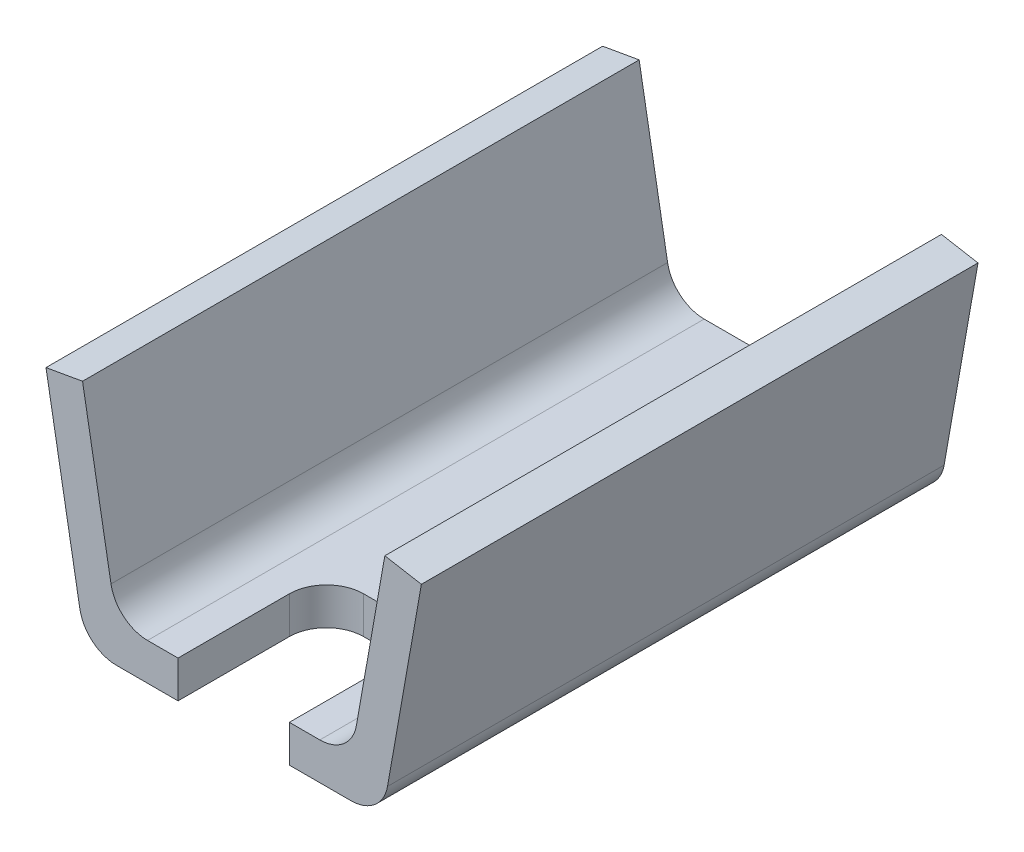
ISO-10303-21;
HEADER;
FILE_DESCRIPTION(('STEP AP214'),'2;1');
FILE_NAME('part.step','',(''),(''),'','','');
FILE_SCHEMA(('AUTOMOTIVE_DESIGN { 1 0 10303 214 1 1 1 1 }'));
ENDSEC;
DATA;
#1=APPLICATION_CONTEXT('core data for automotive mechanical design processes');
#2=APPLICATION_PROTOCOL_DEFINITION('international standard','automotive_design',2000,#1);
#3=PRODUCT_CONTEXT('',#1,'mechanical');
#4=PRODUCT('Part','Part','',(#3));
#5=PRODUCT_RELATED_PRODUCT_CATEGORY('part','',(#4));
#6=PRODUCT_DEFINITION_FORMATION('','',#4);
#7=PRODUCT_DEFINITION_CONTEXT('part definition',#1,'design');
#8=PRODUCT_DEFINITION('design','',#6,#7);
#9=PRODUCT_DEFINITION_SHAPE('','',#8);
#10=(LENGTH_UNIT() NAMED_UNIT(*) SI_UNIT(.MILLI.,.METRE.));
#11=(NAMED_UNIT(*) PLANE_ANGLE_UNIT() SI_UNIT($,.RADIAN.));
#12=(NAMED_UNIT(*) SI_UNIT($,.STERADIAN.) SOLID_ANGLE_UNIT());
#13=UNCERTAINTY_MEASURE_WITH_UNIT(LENGTH_MEASURE(1.E-05),#10,'distance_accuracy_value','');
#14=(GEOMETRIC_REPRESENTATION_CONTEXT(3) GLOBAL_UNCERTAINTY_ASSIGNED_CONTEXT((#13)) GLOBAL_UNIT_ASSIGNED_CONTEXT((#10,
#11,#12)) REPRESENTATION_CONTEXT('',''));
#15=CARTESIAN_POINT('',(0.,0.,0.));
#16=DIRECTION('',(0.,0.,1.));
#17=DIRECTION('',(1.,0.,0.));
#18=AXIS2_PLACEMENT_3D('',#15,#16,#17);
#19=CARTESIAN_POINT('',(11.6090036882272,10.,75.));
#20=DIRECTION('',(0.,0.,1.));
#21=DIRECTION('',(1.,0.,0.));
#22=AXIS2_PLACEMENT_3D('',#19,#20,#21);
#23=PLANE('',#22);
#24=DIRECTION('',(0.,-1.,0.));
#25=VECTOR('',#24,1.);
#26=CARTESIAN_POINT('',(-7.5,10.,75.));
#27=LINE('',#26,#25);
#28=CARTESIAN_POINT('',(-7.5,5.,75.));
#29=VERTEX_POINT('',#28);
#30=CARTESIAN_POINT('',(-7.5,0.,75.));
#31=VERTEX_POINT('',#30);
#32=EDGE_CURVE('E11',#29,#31,#27,.T.);
#33=ORIENTED_EDGE('',*,*,#32,.F.);
#34=DIRECTION('',(-1.,0.,0.));
#35=VECTOR('',#34,1.);
#36=CARTESIAN_POINT('',(11.6090036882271,5.,75.));
#37=LINE('',#36,#35);
#38=CARTESIAN_POINT('',(-11.6090036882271,5.,75.));
#39=VERTEX_POINT('',#38);
#40=EDGE_CURVE('E248',#29,#39,#37,.T.);
#41=ORIENTED_EDGE('',*,*,#40,.T.);
#42=CARTESIAN_POINT('',(-11.6090036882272,9.99999999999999,75.));
#43=DIRECTION('',(0.,0.,-1.));
#44=DIRECTION('',(-1.,0.,0.));
#45=AXIS2_PLACEMENT_3D('',#42,#43,#44);
#46=CIRCLE('',#45,5.);
#47=CARTESIAN_POINT('',(-16.5330424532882,9.13175911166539,75.));
#48=VERTEX_POINT('',#47);
#49=EDGE_CURVE('E247',#39,#48,#46,.T.);
#50=ORIENTED_EDGE('',*,*,#49,.T.);
#51=DIRECTION('',(-0.173648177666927,0.984807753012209,0.));
#52=VECTOR('',#51,1.);
#53=CARTESIAN_POINT('',(-16.5330424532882,9.13175911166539,75.));
#54=LINE('',#53,#52);
#55=CARTESIAN_POINT('',(-20.3657706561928,30.8682408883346,75.));
#56=VERTEX_POINT('',#55);
#57=EDGE_CURVE('E250',#48,#56,#54,.T.);
#58=ORIENTED_EDGE('',*,*,#57,.T.);
#59=DIRECTION('',(-0.984807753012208,-0.173648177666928,0.));
#60=VECTOR('',#59,1.);
#61=CARTESIAN_POINT('',(-25.2898094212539,30.,75.));
#62=LINE('',#61,#60);
#63=CARTESIAN_POINT('',(-25.2898094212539,30.,75.));
#64=VERTEX_POINT('',#63);
#65=EDGE_CURVE('E256',#56,#64,#62,.T.);
#66=ORIENTED_EDGE('',*,*,#65,.T.);
#67=DIRECTION('',(0.173648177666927,-0.984807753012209,0.));
#68=VECTOR('',#67,1.);
#69=CARTESIAN_POINT('',(-20.7285406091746,4.13175911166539,75.));
#70=LINE('',#69,#68);
#71=CARTESIAN_POINT('',(-20.7285406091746,4.13175911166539,75.));
#72=VERTEX_POINT('',#71);
#73=EDGE_CURVE('E258',#64,#72,#70,.T.);
#74=ORIENTED_EDGE('',*,*,#73,.T.);
#75=CARTESIAN_POINT('',(-15.8045018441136,5.,75.));
#76=DIRECTION('',(0.,0.,1.));
#77=DIRECTION('',(-1.,0.,0.));
#78=AXIS2_PLACEMENT_3D('',#75,#76,#77);
#79=CIRCLE('',#78,5.);
#80=CARTESIAN_POINT('',(-15.8045018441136,0.,75.));
#81=VERTEX_POINT('',#80);
#82=EDGE_CURVE('E153',#72,#81,#79,.T.);
#83=ORIENTED_EDGE('',*,*,#82,.T.);
#84=DIRECTION('',(1.,0.,0.));
#85=VECTOR('',#84,1.);
#86=CARTESIAN_POINT('',(-15.8045018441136,0.,75.));
#87=LINE('',#86,#85);
#88=EDGE_CURVE('E152',#81,#31,#87,.T.);
#89=ORIENTED_EDGE('',*,*,#88,.T.);
#90=EDGE_LOOP('',(#33,#41,#50,#58,#66,#74,#83,#89));
#91=FACE_BOUND('',#90,.T.);
#92=ADVANCED_FACE('F39',(#91),#23,.T.);
#93=CARTESIAN_POINT('',(25.2898094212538,30.,75.));
#94=DIRECTION('',(-0.173648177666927,-0.984807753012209,0.));
#95=DIRECTION('',(0.984807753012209,-0.173648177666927,0.));
#96=AXIS2_PLACEMENT_3D('',#93,#94,#95);
#97=PLANE('',#96);
#98=DIRECTION('',(-0.984807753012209,0.173648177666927,0.));
#99=VECTOR('',#98,1.);
#100=CARTESIAN_POINT('',(25.2898094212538,30.,0.));
#101=LINE('',#100,#99);
#102=CARTESIAN_POINT('',(25.2898094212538,30.,0.));
#103=VERTEX_POINT('',#102);
#104=CARTESIAN_POINT('',(20.3657706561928,30.8682408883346,0.));
#105=VERTEX_POINT('',#104);
#106=EDGE_CURVE('E174',#103,#105,#101,.T.);
#107=ORIENTED_EDGE('',*,*,#106,.T.);
#108=DIRECTION('',(0.,0.,-1.));
#109=VECTOR('',#108,1.);
#110=CARTESIAN_POINT('',(20.3657706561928,30.8682408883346,75.));
#111=LINE('',#110,#109);
#112=CARTESIAN_POINT('',(20.3657706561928,30.8682408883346,75.));
#113=VERTEX_POINT('',#112);
#114=EDGE_CURVE('E223',#113,#105,#111,.T.);
#115=ORIENTED_EDGE('',*,*,#114,.F.);
#116=DIRECTION('',(-0.984807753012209,0.173648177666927,0.));
#117=VECTOR('',#116,1.);
#118=CARTESIAN_POINT('',(25.2898094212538,30.,75.));
#119=LINE('',#118,#117);
#120=CARTESIAN_POINT('',(25.2898094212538,30.,75.));
#121=VERTEX_POINT('',#120);
#122=EDGE_CURVE('E198',#121,#113,#119,.T.);
#123=ORIENTED_EDGE('',*,*,#122,.F.);
#124=DIRECTION('',(0.,0.,-1.));
#125=VECTOR('',#124,1.);
#126=CARTESIAN_POINT('',(25.2898094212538,30.,75.));
#127=LINE('',#126,#125);
#128=EDGE_CURVE('E169',#121,#103,#127,.T.);
#129=ORIENTED_EDGE('',*,*,#128,.T.);
#130=EDGE_LOOP('',(#107,#115,#123,#129));
#131=FACE_BOUND('',#130,.T.);
#132=ADVANCED_FACE('F41',(#131),#97,.F.);
#133=CARTESIAN_POINT('',(20.3657706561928,30.8682408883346,75.));
#134=DIRECTION('',(0.984807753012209,-0.173648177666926,0.));
#135=DIRECTION('',(0.173648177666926,0.984807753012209,0.));
#136=AXIS2_PLACEMENT_3D('',#133,#134,#135);
#137=PLANE('',#136);
#138=DIRECTION('',(-0.173648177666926,-0.984807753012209,0.));
#139=VECTOR('',#138,1.);
#140=CARTESIAN_POINT('',(20.3657706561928,30.8682408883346,0.));
#141=LINE('',#140,#139);
#142=CARTESIAN_POINT('',(16.5330424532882,9.13175911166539,0.));
#143=VERTEX_POINT('',#142);
#144=EDGE_CURVE('E177',#105,#143,#141,.T.);
#145=ORIENTED_EDGE('',*,*,#144,.T.);
#146=DIRECTION('',(0.,0.,-1.));
#147=VECTOR('',#146,1.);
#148=CARTESIAN_POINT('',(16.5330424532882,9.13175911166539,75.));
#149=LINE('',#148,#147);
#150=CARTESIAN_POINT('',(16.5330424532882,9.13175911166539,75.));
#151=VERTEX_POINT('',#150);
#152=EDGE_CURVE('E220',#151,#143,#149,.T.);
#153=ORIENTED_EDGE('',*,*,#152,.F.);
#154=DIRECTION('',(-0.173648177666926,-0.984807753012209,0.));
#155=VECTOR('',#154,1.);
#156=CARTESIAN_POINT('',(20.3657706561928,30.8682408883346,75.));
#157=LINE('',#156,#155);
#158=EDGE_CURVE('E117',#113,#151,#157,.T.);
#159=ORIENTED_EDGE('',*,*,#158,.F.);
#160=ORIENTED_EDGE('',*,*,#114,.T.);
#161=EDGE_LOOP('',(#145,#153,#159,#160));
#162=FACE_BOUND('',#161,.T.);
#163=ADVANCED_FACE('F311',(#162),#137,.F.);
#164=CARTESIAN_POINT('',(11.6090036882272,10.,75.));
#165=DIRECTION('',(0.,0.,-1.));
#166=DIRECTION('',(-1.,0.,0.));
#167=AXIS2_PLACEMENT_3D('',#164,#165,#166);
#168=CYLINDRICAL_SURFACE('',#167,5.);
#169=CARTESIAN_POINT('',(11.6090036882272,10.,0.));
#170=DIRECTION('',(0.,0.,-1.));
#171=DIRECTION('',(1.,0.,0.));
#172=AXIS2_PLACEMENT_3D('',#169,#170,#171);
#173=CIRCLE('',#172,5.);
#174=CARTESIAN_POINT('',(11.6090036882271,5.,0.));
#175=VERTEX_POINT('',#174);
#176=EDGE_CURVE('E180',#143,#175,#173,.T.);
#177=ORIENTED_EDGE('',*,*,#176,.T.);
#178=DIRECTION('',(0.,0.,-1.));
#179=VECTOR('',#178,1.);
#180=CARTESIAN_POINT('',(11.6090036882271,5.,75.));
#181=LINE('',#180,#179);
#182=CARTESIAN_POINT('',(11.6090036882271,5.,75.));
#183=VERTEX_POINT('',#182);
#184=EDGE_CURVE('E217',#183,#175,#181,.T.);
#185=ORIENTED_EDGE('',*,*,#184,.F.);
#186=CARTESIAN_POINT('',(11.6090036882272,10.,75.));
#187=DIRECTION('',(0.,0.,-1.));
#188=DIRECTION('',(1.,0.,0.));
#189=AXIS2_PLACEMENT_3D('',#186,#187,#188);
#190=CIRCLE('',#189,5.);
#191=EDGE_CURVE('E245',#151,#183,#190,.T.);
#192=ORIENTED_EDGE('',*,*,#191,.F.);
#193=ORIENTED_EDGE('',*,*,#152,.T.);
#194=EDGE_LOOP('',(#177,#185,#192,#193));
#195=FACE_BOUND('',#194,.T.);
#196=ADVANCED_FACE('F314',(#195),#168,.F.);
#197=CARTESIAN_POINT('',(11.6090036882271,5.,75.));
#198=DIRECTION('',(0.,-1.,0.));
#199=DIRECTION('',(1.,0.,0.));
#200=AXIS2_PLACEMENT_3D('',#197,#198,#199);
#201=PLANE('',#200);
#202=ORIENTED_EDGE('',*,*,#40,.F.);
#203=DIRECTION('',(0.,0.,-1.));
#204=VECTOR('',#203,1.);
#205=CARTESIAN_POINT('',(-7.5,5.,75.));
#206=LINE('',#205,#204);
#207=CARTESIAN_POINT('',(-7.5,5.,60.));
#208=VERTEX_POINT('',#207);
#209=EDGE_CURVE('E241',#29,#208,#206,.T.);
#210=ORIENTED_EDGE('',*,*,#209,.T.);
#211=CARTESIAN_POINT('',(-2.5,5.,60.));
#212=DIRECTION('',(0.,-1.,0.));
#213=DIRECTION('',(1.,0.,0.));
#214=AXIS2_PLACEMENT_3D('',#211,#212,#213);
#215=CIRCLE('',#214,5.);
#216=CARTESIAN_POINT('',(-2.5,5.,55.));
#217=VERTEX_POINT('',#216);
#218=EDGE_CURVE('E303',#208,#217,#215,.T.);
#219=ORIENTED_EDGE('',*,*,#218,.T.);
#220=DIRECTION('',(1.,0.,0.));
#221=VECTOR('',#220,1.);
#222=CARTESIAN_POINT('',(11.6090036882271,5.,55.));
#223=LINE('',#222,#221);
#224=CARTESIAN_POINT('',(2.5,5.,55.));
#225=VERTEX_POINT('',#224);
#226=EDGE_CURVE('E306',#217,#225,#223,.T.);
#227=ORIENTED_EDGE('',*,*,#226,.T.);
#228=CARTESIAN_POINT('',(2.5,5.,60.));
#229=DIRECTION('',(0.,-1.,0.));
#230=DIRECTION('',(1.,0.,0.));
#231=AXIS2_PLACEMENT_3D('',#228,#229,#230);
#232=CIRCLE('',#231,5.);
#233=CARTESIAN_POINT('',(7.5,5.,60.));
#234=VERTEX_POINT('',#233);
#235=EDGE_CURVE('E178',#225,#234,#232,.T.);
#236=ORIENTED_EDGE('',*,*,#235,.T.);
#237=DIRECTION('',(0.,0.,1.));
#238=VECTOR('',#237,1.);
#239=CARTESIAN_POINT('',(7.49999999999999,5.,75.));
#240=LINE('',#239,#238);
#241=CARTESIAN_POINT('',(7.49999999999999,5.,75.));
#242=VERTEX_POINT('',#241);
#243=EDGE_CURVE('E229',#234,#242,#240,.T.);
#244=ORIENTED_EDGE('',*,*,#243,.T.);
#245=EDGE_CURVE('E238',#183,#242,#37,.T.);
#246=ORIENTED_EDGE('',*,*,#245,.F.);
#247=ORIENTED_EDGE('',*,*,#184,.T.);
#248=DIRECTION('',(-1.,0.,0.));
#249=VECTOR('',#248,1.);
#250=CARTESIAN_POINT('',(11.6090036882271,5.,0.));
#251=LINE('',#250,#249);
#252=CARTESIAN_POINT('',(-11.6090036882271,5.,0.));
#253=VERTEX_POINT('',#252);
#254=EDGE_CURVE('E182',#175,#253,#251,.T.);
#255=ORIENTED_EDGE('',*,*,#254,.T.);
#256=DIRECTION('',(0.,0.,-1.));
#257=VECTOR('',#256,1.);
#258=CARTESIAN_POINT('',(-11.6090036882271,5.,75.));
#259=LINE('',#258,#257);
#260=EDGE_CURVE('E214',#39,#253,#259,.T.);
#261=ORIENTED_EDGE('',*,*,#260,.F.);
#262=EDGE_LOOP('',(#202,#210,#219,#227,#236,#244,#246,#247,#255,#261));
#263=FACE_BOUND('',#262,.T.);
#264=ADVANCED_FACE('F237',(#263),#201,.F.);
#265=CARTESIAN_POINT('',(-11.6090036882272,9.99999999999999,75.));
#266=DIRECTION('',(0.,0.,-1.));
#267=DIRECTION('',(-1.,0.,0.));
#268=AXIS2_PLACEMENT_3D('',#265,#266,#267);
#269=CYLINDRICAL_SURFACE('',#268,5.);
#270=CARTESIAN_POINT('',(-11.6090036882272,9.99999999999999,0.));
#271=DIRECTION('',(0.,0.,-1.));
#272=DIRECTION('',(-1.,0.,0.));
#273=AXIS2_PLACEMENT_3D('',#270,#271,#272);
#274=CIRCLE('',#273,5.);
#275=CARTESIAN_POINT('',(-16.5330424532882,9.13175911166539,0.));
#276=VERTEX_POINT('',#275);
#277=EDGE_CURVE('E184',#253,#276,#274,.T.);
#278=ORIENTED_EDGE('',*,*,#277,.T.);
#279=DIRECTION('',(0.,0.,-1.));
#280=VECTOR('',#279,1.);
#281=CARTESIAN_POINT('',(-16.5330424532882,9.13175911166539,75.));
#282=LINE('',#281,#280);
#283=EDGE_CURVE('E211',#48,#276,#282,.T.);
#284=ORIENTED_EDGE('',*,*,#283,.F.);
#285=ORIENTED_EDGE('',*,*,#49,.F.);
#286=ORIENTED_EDGE('',*,*,#260,.T.);
#287=EDGE_LOOP('',(#278,#284,#285,#286));
#288=FACE_BOUND('',#287,.T.);
#289=ADVANCED_FACE('F325',(#288),#269,.F.);
#290=CARTESIAN_POINT('',(-16.5330424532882,9.13175911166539,75.));
#291=DIRECTION('',(-0.984807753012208,-0.173648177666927,0.));
#292=DIRECTION('',(0.173648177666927,-0.984807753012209,0.));
#293=AXIS2_PLACEMENT_3D('',#290,#291,#292);
#294=PLANE('',#293);
#295=DIRECTION('',(-0.173648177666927,0.984807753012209,0.));
#296=VECTOR('',#295,1.);
#297=CARTESIAN_POINT('',(-16.5330424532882,9.13175911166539,0.));
#298=LINE('',#297,#296);
#299=CARTESIAN_POINT('',(-20.3657706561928,30.8682408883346,0.));
#300=VERTEX_POINT('',#299);
#301=EDGE_CURVE('E186',#276,#300,#298,.T.);
#302=ORIENTED_EDGE('',*,*,#301,.T.);
#303=DIRECTION('',(0.,0.,-1.));
#304=VECTOR('',#303,1.);
#305=CARTESIAN_POINT('',(-20.3657706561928,30.8682408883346,75.));
#306=LINE('',#305,#304);
#307=EDGE_CURVE('E208',#56,#300,#306,.T.);
#308=ORIENTED_EDGE('',*,*,#307,.F.);
#309=ORIENTED_EDGE('',*,*,#57,.F.);
#310=ORIENTED_EDGE('',*,*,#283,.T.);
#311=EDGE_LOOP('',(#302,#308,#309,#310));
#312=FACE_BOUND('',#311,.T.);
#313=ADVANCED_FACE('F329',(#312),#294,.F.);
#314=CARTESIAN_POINT('',(-25.2898094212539,30.,75.));
#315=DIRECTION('',(0.173648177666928,-0.984807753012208,0.));
#316=DIRECTION('',(0.984807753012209,0.173648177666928,0.));
#317=AXIS2_PLACEMENT_3D('',#314,#315,#316);
#318=PLANE('',#317);
#319=DIRECTION('',(-0.984807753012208,-0.173648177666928,0.));
#320=VECTOR('',#319,1.);
#321=CARTESIAN_POINT('',(-25.2898094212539,30.,0.));
#322=LINE('',#321,#320);
#323=CARTESIAN_POINT('',(-25.2898094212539,30.,0.));
#324=VERTEX_POINT('',#323);
#325=EDGE_CURVE('E188',#300,#324,#322,.T.);
#326=ORIENTED_EDGE('',*,*,#325,.T.);
#327=DIRECTION('',(0.,0.,-1.));
#328=VECTOR('',#327,1.);
#329=CARTESIAN_POINT('',(-25.2898094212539,30.,75.));
#330=LINE('',#329,#328);
#331=EDGE_CURVE('E205',#64,#324,#330,.T.);
#332=ORIENTED_EDGE('',*,*,#331,.F.);
#333=ORIENTED_EDGE('',*,*,#65,.F.);
#334=ORIENTED_EDGE('',*,*,#307,.T.);
#335=EDGE_LOOP('',(#326,#332,#333,#334));
#336=FACE_BOUND('',#335,.T.);
#337=ADVANCED_FACE('F388',(#336),#318,.F.);
#338=CARTESIAN_POINT('',(-20.7285406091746,4.13175911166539,75.));
#339=DIRECTION('',(0.984807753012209,0.173648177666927,0.));
#340=DIRECTION('',(-0.173648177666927,0.984807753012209,0.));
#341=AXIS2_PLACEMENT_3D('',#338,#339,#340);
#342=PLANE('',#341);
#343=DIRECTION('',(0.173648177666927,-0.984807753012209,0.));
#344=VECTOR('',#343,1.);
#345=CARTESIAN_POINT('',(-20.7285406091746,4.13175911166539,0.));
#346=LINE('',#345,#344);
#347=CARTESIAN_POINT('',(-20.7285406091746,4.13175911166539,0.));
#348=VERTEX_POINT('',#347);
#349=EDGE_CURVE('E190',#324,#348,#346,.T.);
#350=ORIENTED_EDGE('',*,*,#349,.T.);
#351=DIRECTION('',(0.,0.,-1.));
#352=VECTOR('',#351,1.);
#353=CARTESIAN_POINT('',(-20.7285406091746,4.13175911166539,75.));
#354=LINE('',#353,#352);
#355=EDGE_CURVE('E202',#72,#348,#354,.T.);
#356=ORIENTED_EDGE('',*,*,#355,.F.);
#357=ORIENTED_EDGE('',*,*,#73,.F.);
#358=ORIENTED_EDGE('',*,*,#331,.T.);
#359=EDGE_LOOP('',(#350,#356,#357,#358));
#360=FACE_BOUND('',#359,.T.);
#361=ADVANCED_FACE('F385',(#360),#342,.F.);
#362=CARTESIAN_POINT('',(-15.8045018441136,5.,75.));
#363=DIRECTION('',(0.,0.,-1.));
#364=DIRECTION('',(-1.,0.,0.));
#365=AXIS2_PLACEMENT_3D('',#362,#363,#364);
#366=CYLINDRICAL_SURFACE('',#365,5.);
#367=CARTESIAN_POINT('',(-15.8045018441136,5.,0.));
#368=DIRECTION('',(0.,0.,1.));
#369=DIRECTION('',(-1.,0.,0.));
#370=AXIS2_PLACEMENT_3D('',#367,#368,#369);
#371=CIRCLE('',#370,5.);
#372=CARTESIAN_POINT('',(-15.8045018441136,0.,0.));
#373=VERTEX_POINT('',#372);
#374=EDGE_CURVE('E192',#348,#373,#371,.T.);
#375=ORIENTED_EDGE('',*,*,#374,.T.);
#376=DIRECTION('',(0.,0.,-1.));
#377=VECTOR('',#376,1.);
#378=CARTESIAN_POINT('',(-15.8045018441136,0.,75.));
#379=LINE('',#378,#377);
#380=EDGE_CURVE('E164',#81,#373,#379,.T.);
#381=ORIENTED_EDGE('',*,*,#380,.F.);
#382=ORIENTED_EDGE('',*,*,#82,.F.);
#383=ORIENTED_EDGE('',*,*,#355,.T.);
#384=EDGE_LOOP('',(#375,#381,#382,#383));
#385=FACE_BOUND('',#384,.T.);
#386=ADVANCED_FACE('F268',(#385),#366,.T.);
#387=CARTESIAN_POINT('',(-15.8045018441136,0.,75.));
#388=DIRECTION('',(0.,1.,0.));
#389=DIRECTION('',(0.,0.,1.));
#390=AXIS2_PLACEMENT_3D('',#387,#388,#389);
#391=PLANE('',#390);
#392=CARTESIAN_POINT('',(-2.5,0.,60.));
#393=DIRECTION('',(0.,-1.,0.));
#394=DIRECTION('',(0.,0.,1.));
#395=AXIS2_PLACEMENT_3D('',#392,#393,#394);
#396=CIRCLE('',#395,5.);
#397=CARTESIAN_POINT('',(-7.5,0.,60.));
#398=VERTEX_POINT('',#397);
#399=CARTESIAN_POINT('',(-2.5,0.,55.));
#400=VERTEX_POINT('',#399);
#401=EDGE_CURVE('E276',#398,#400,#396,.T.);
#402=ORIENTED_EDGE('',*,*,#401,.F.);
#403=DIRECTION('',(0.,0.,-1.));
#404=VECTOR('',#403,1.);
#405=CARTESIAN_POINT('',(-7.5,0.,60.));
#406=LINE('',#405,#404);
#407=EDGE_CURVE('E272',#31,#398,#406,.T.);
#408=ORIENTED_EDGE('',*,*,#407,.F.);
#409=ORIENTED_EDGE('',*,*,#88,.F.);
#410=ORIENTED_EDGE('',*,*,#380,.T.);
#411=DIRECTION('',(1.,0.,0.));
#412=VECTOR('',#411,1.);
#413=CARTESIAN_POINT('',(-15.8045018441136,0.,0.));
#414=LINE('',#413,#412);
#415=CARTESIAN_POINT('',(15.8045018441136,0.,0.));
#416=VERTEX_POINT('',#415);
#417=EDGE_CURVE('E161',#373,#416,#414,.T.);
#418=ORIENTED_EDGE('',*,*,#417,.T.);
#419=DIRECTION('',(0.,0.,-1.));
#420=VECTOR('',#419,1.);
#421=CARTESIAN_POINT('',(15.8045018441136,0.,75.));
#422=LINE('',#421,#420);
#423=CARTESIAN_POINT('',(15.8045018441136,0.,75.));
#424=VERTEX_POINT('',#423);
#425=EDGE_CURVE('E156',#424,#416,#422,.T.);
#426=ORIENTED_EDGE('',*,*,#425,.F.);
#427=CARTESIAN_POINT('',(7.5,0.,75.));
#428=VERTEX_POINT('',#427);
#429=EDGE_CURVE('E144',#428,#424,#87,.T.);
#430=ORIENTED_EDGE('',*,*,#429,.F.);
#431=DIRECTION('',(0.,0.,1.));
#432=VECTOR('',#431,1.);
#433=CARTESIAN_POINT('',(7.49999999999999,0.,75.));
#434=LINE('',#433,#432);
#435=CARTESIAN_POINT('',(7.5,0.,60.));
#436=VERTEX_POINT('',#435);
#437=EDGE_CURVE('E54',#436,#428,#434,.T.);
#438=ORIENTED_EDGE('',*,*,#437,.F.);
#439=CARTESIAN_POINT('',(2.5,0.,60.));
#440=DIRECTION('',(0.,-1.,0.));
#441=DIRECTION('',(0.,0.,1.));
#442=AXIS2_PLACEMENT_3D('',#439,#440,#441);
#443=CIRCLE('',#442,5.);
#444=CARTESIAN_POINT('',(2.5,0.,55.));
#445=VERTEX_POINT('',#444);
#446=EDGE_CURVE('E287',#445,#436,#443,.T.);
#447=ORIENTED_EDGE('',*,*,#446,.F.);
#448=DIRECTION('',(1.,0.,0.));
#449=VECTOR('',#448,1.);
#450=CARTESIAN_POINT('',(2.5,0.,55.));
#451=LINE('',#450,#449);
#452=EDGE_CURVE('E282',#400,#445,#451,.T.);
#453=ORIENTED_EDGE('',*,*,#452,.F.);
#454=EDGE_LOOP('',(#402,#408,#409,#410,#418,#426,#430,#438,#447,#453));
#455=FACE_BOUND('',#454,.T.);
#456=ADVANCED_FACE('F158',(#455),#391,.F.);
#457=CARTESIAN_POINT('',(15.8045018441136,5.,75.));
#458=DIRECTION('',(0.,0.,-1.));
#459=DIRECTION('',(-1.,0.,0.));
#460=AXIS2_PLACEMENT_3D('',#457,#458,#459);
#461=CYLINDRICAL_SURFACE('',#460,5.);
#462=CARTESIAN_POINT('',(15.8045018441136,5.,0.));
#463=DIRECTION('',(0.,0.,1.));
#464=DIRECTION('',(1.,0.,0.));
#465=AXIS2_PLACEMENT_3D('',#462,#463,#464);
#466=CIRCLE('',#465,5.);
#467=CARTESIAN_POINT('',(20.7285406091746,4.1317591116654,0.));
#468=VERTEX_POINT('',#467);
#469=EDGE_CURVE('E195',#416,#468,#466,.T.);
#470=ORIENTED_EDGE('',*,*,#469,.T.);
#471=DIRECTION('',(0.,0.,-1.));
#472=VECTOR('',#471,1.);
#473=CARTESIAN_POINT('',(20.7285406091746,4.1317591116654,75.));
#474=LINE('',#473,#472);
#475=CARTESIAN_POINT('',(20.7285406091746,4.1317591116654,75.));
#476=VERTEX_POINT('',#475);
#477=EDGE_CURVE('E165',#476,#468,#474,.T.);
#478=ORIENTED_EDGE('',*,*,#477,.F.);
#479=CARTESIAN_POINT('',(15.8045018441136,5.,75.));
#480=DIRECTION('',(0.,0.,1.));
#481=DIRECTION('',(1.,0.,0.));
#482=AXIS2_PLACEMENT_3D('',#479,#480,#481);
#483=CIRCLE('',#482,5.);
#484=EDGE_CURVE('E148',#424,#476,#483,.T.);
#485=ORIENTED_EDGE('',*,*,#484,.F.);
#486=ORIENTED_EDGE('',*,*,#425,.T.);
#487=EDGE_LOOP('',(#470,#478,#485,#486));
#488=FACE_BOUND('',#487,.T.);
#489=ADVANCED_FACE('F167',(#488),#461,.T.);
#490=CARTESIAN_POINT('',(20.7285406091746,4.1317591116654,75.));
#491=DIRECTION('',(-0.984807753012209,0.173648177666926,0.));
#492=DIRECTION('',(-0.173648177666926,-0.984807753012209,0.));
#493=AXIS2_PLACEMENT_3D('',#490,#491,#492);
#494=PLANE('',#493);
#495=DIRECTION('',(0.173648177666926,0.984807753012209,0.));
#496=VECTOR('',#495,1.);
#497=CARTESIAN_POINT('',(20.7285406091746,4.1317591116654,0.));
#498=LINE('',#497,#496);
#499=EDGE_CURVE('E108',#468,#103,#498,.T.);
#500=ORIENTED_EDGE('',*,*,#499,.T.);
#501=ORIENTED_EDGE('',*,*,#128,.F.);
#502=DIRECTION('',(0.173648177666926,0.984807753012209,0.));
#503=VECTOR('',#502,1.);
#504=CARTESIAN_POINT('',(20.7285406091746,4.1317591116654,75.));
#505=LINE('',#504,#503);
#506=EDGE_CURVE('E63',#476,#121,#505,.T.);
#507=ORIENTED_EDGE('',*,*,#506,.F.);
#508=ORIENTED_EDGE('',*,*,#477,.T.);
#509=EDGE_LOOP('',(#500,#501,#507,#508));
#510=FACE_BOUND('',#509,.T.);
#511=ADVANCED_FACE('F370',(#510),#494,.F.);
#512=DIRECTION('',(0.,1.,0.));
#513=VECTOR('',#512,1.);
#514=CARTESIAN_POINT('',(7.49999999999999,10.,75.));
#515=LINE('',#514,#513);
#516=EDGE_CURVE('E47',#428,#242,#515,.T.);
#517=ORIENTED_EDGE('',*,*,#516,.F.);
#518=ORIENTED_EDGE('',*,*,#429,.T.);
#519=ORIENTED_EDGE('',*,*,#484,.T.);
#520=ORIENTED_EDGE('',*,*,#506,.T.);
#521=ORIENTED_EDGE('',*,*,#122,.T.);
#522=ORIENTED_EDGE('',*,*,#158,.T.);
#523=ORIENTED_EDGE('',*,*,#191,.T.);
#524=ORIENTED_EDGE('',*,*,#245,.T.);
#525=EDGE_LOOP('',(#517,#518,#519,#520,#521,#522,#523,#524));
#526=FACE_BOUND('',#525,.T.);
#527=ADVANCED_FACE('F146',(#526),#23,.T.);
#528=CARTESIAN_POINT('',(11.6090036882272,10.,0.));
#529=DIRECTION('',(0.,0.,1.));
#530=DIRECTION('',(1.,0.,0.));
#531=AXIS2_PLACEMENT_3D('',#528,#529,#530);
#532=PLANE('',#531);
#533=ORIENTED_EDGE('',*,*,#106,.F.);
#534=ORIENTED_EDGE('',*,*,#499,.F.);
#535=ORIENTED_EDGE('',*,*,#469,.F.);
#536=ORIENTED_EDGE('',*,*,#417,.F.);
#537=ORIENTED_EDGE('',*,*,#374,.F.);
#538=ORIENTED_EDGE('',*,*,#349,.F.);
#539=ORIENTED_EDGE('',*,*,#325,.F.);
#540=ORIENTED_EDGE('',*,*,#301,.F.);
#541=ORIENTED_EDGE('',*,*,#277,.F.);
#542=ORIENTED_EDGE('',*,*,#254,.F.);
#543=ORIENTED_EDGE('',*,*,#176,.F.);
#544=ORIENTED_EDGE('',*,*,#144,.F.);
#545=EDGE_LOOP('',(#533,#534,#535,#536,#537,#538,#539,#540,#541,#542,#543,#544));
#546=FACE_BOUND('',#545,.T.);
#547=ADVANCED_FACE('F320',(#546),#532,.F.);
#548=CARTESIAN_POINT('',(2.5,30.8682408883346,60.));
#549=DIRECTION('',(0.,-1.,0.));
#550=DIRECTION('',(0.,0.,-1.));
#551=AXIS2_PLACEMENT_3D('',#548,#549,#550);
#552=CYLINDRICAL_SURFACE('',#551,5.);
#553=DIRECTION('',(0.,-1.,0.));
#554=VECTOR('',#553,1.);
#555=CARTESIAN_POINT('',(2.5,30.8682408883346,55.));
#556=LINE('',#555,#554);
#557=EDGE_CURVE('E293',#225,#445,#556,.T.);
#558=ORIENTED_EDGE('',*,*,#557,.T.);
#559=ORIENTED_EDGE('',*,*,#446,.T.);
#560=DIRECTION('',(0.,-1.,0.));
#561=VECTOR('',#560,1.);
#562=CARTESIAN_POINT('',(7.5,30.8682408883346,60.));
#563=LINE('',#562,#561);
#564=EDGE_CURVE('E242',#234,#436,#563,.T.);
#565=ORIENTED_EDGE('',*,*,#564,.F.);
#566=ORIENTED_EDGE('',*,*,#235,.F.);
#567=EDGE_LOOP('',(#558,#559,#565,#566));
#568=FACE_BOUND('',#567,.T.);
#569=ADVANCED_FACE('F345',(#568),#552,.F.);
#570=CARTESIAN_POINT('',(2.5,30.8682408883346,55.));
#571=DIRECTION('',(0.,0.,-1.));
#572=DIRECTION('',(-1.,0.,0.));
#573=AXIS2_PLACEMENT_3D('',#570,#571,#572);
#574=PLANE('',#573);
#575=DIRECTION('',(0.,-1.,0.));
#576=VECTOR('',#575,1.);
#577=CARTESIAN_POINT('',(-2.5,30.8682408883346,55.));
#578=LINE('',#577,#576);
#579=EDGE_CURVE('E296',#217,#400,#578,.T.);
#580=ORIENTED_EDGE('',*,*,#579,.T.);
#581=ORIENTED_EDGE('',*,*,#452,.T.);
#582=ORIENTED_EDGE('',*,*,#557,.F.);
#583=ORIENTED_EDGE('',*,*,#226,.F.);
#584=EDGE_LOOP('',(#580,#581,#582,#583));
#585=FACE_BOUND('',#584,.T.);
#586=ADVANCED_FACE('F347',(#585),#574,.F.);
#587=CARTESIAN_POINT('',(-2.5,30.8682408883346,60.));
#588=DIRECTION('',(0.,-1.,0.));
#589=DIRECTION('',(0.,0.,-1.));
#590=AXIS2_PLACEMENT_3D('',#587,#588,#589);
#591=CYLINDRICAL_SURFACE('',#590,5.);
#592=DIRECTION('',(0.,-1.,0.));
#593=VECTOR('',#592,1.);
#594=CARTESIAN_POINT('',(-7.5,30.8682408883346,60.));
#595=LINE('',#594,#593);
#596=EDGE_CURVE('E291',#208,#398,#595,.T.);
#597=ORIENTED_EDGE('',*,*,#596,.T.);
#598=ORIENTED_EDGE('',*,*,#401,.T.);
#599=ORIENTED_EDGE('',*,*,#579,.F.);
#600=ORIENTED_EDGE('',*,*,#218,.F.);
#601=EDGE_LOOP('',(#597,#598,#599,#600));
#602=FACE_BOUND('',#601,.T.);
#603=ADVANCED_FACE('F350',(#602),#591,.F.);
#604=CARTESIAN_POINT('',(-7.5,30.8682408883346,60.));
#605=DIRECTION('',(-1.,0.,0.));
#606=DIRECTION('',(0.,0.,1.));
#607=AXIS2_PLACEMENT_3D('',#604,#605,#606);
#608=PLANE('',#607);
#609=ORIENTED_EDGE('',*,*,#32,.T.);
#610=ORIENTED_EDGE('',*,*,#407,.T.);
#611=ORIENTED_EDGE('',*,*,#596,.F.);
#612=ORIENTED_EDGE('',*,*,#209,.F.);
#613=EDGE_LOOP('',(#609,#610,#611,#612));
#614=FACE_BOUND('',#613,.T.);
#615=ADVANCED_FACE('F351',(#614),#608,.F.);
#616=CARTESIAN_POINT('',(7.49999999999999,30.8682408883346,75.));
#617=DIRECTION('',(1.,0.,0.));
#618=DIRECTION('',(0.,0.,-1.));
#619=AXIS2_PLACEMENT_3D('',#616,#617,#618);
#620=PLANE('',#619);
#621=ORIENTED_EDGE('',*,*,#564,.T.);
#622=ORIENTED_EDGE('',*,*,#437,.T.);
#623=ORIENTED_EDGE('',*,*,#516,.T.);
#624=ORIENTED_EDGE('',*,*,#243,.F.);
#625=EDGE_LOOP('',(#621,#622,#623,#624));
#626=FACE_BOUND('',#625,.T.);
#627=ADVANCED_FACE('F227',(#626),#620,.F.);
#628=CLOSED_SHELL('',(#92,#132,#163,#196,#264,#289,#313,#337,#361,#386,#456,#489,#511,#527,#547,
#569,#586,#603,#615,#627));
#629=MANIFOLD_SOLID_BREP('B2',#628);
#630=ADVANCED_BREP_SHAPE_REPRESENTATION('',(#18,#629),#14);
#631=SHAPE_DEFINITION_REPRESENTATION(#9,#630);
ENDSEC;
END-ISO-10303-21;
